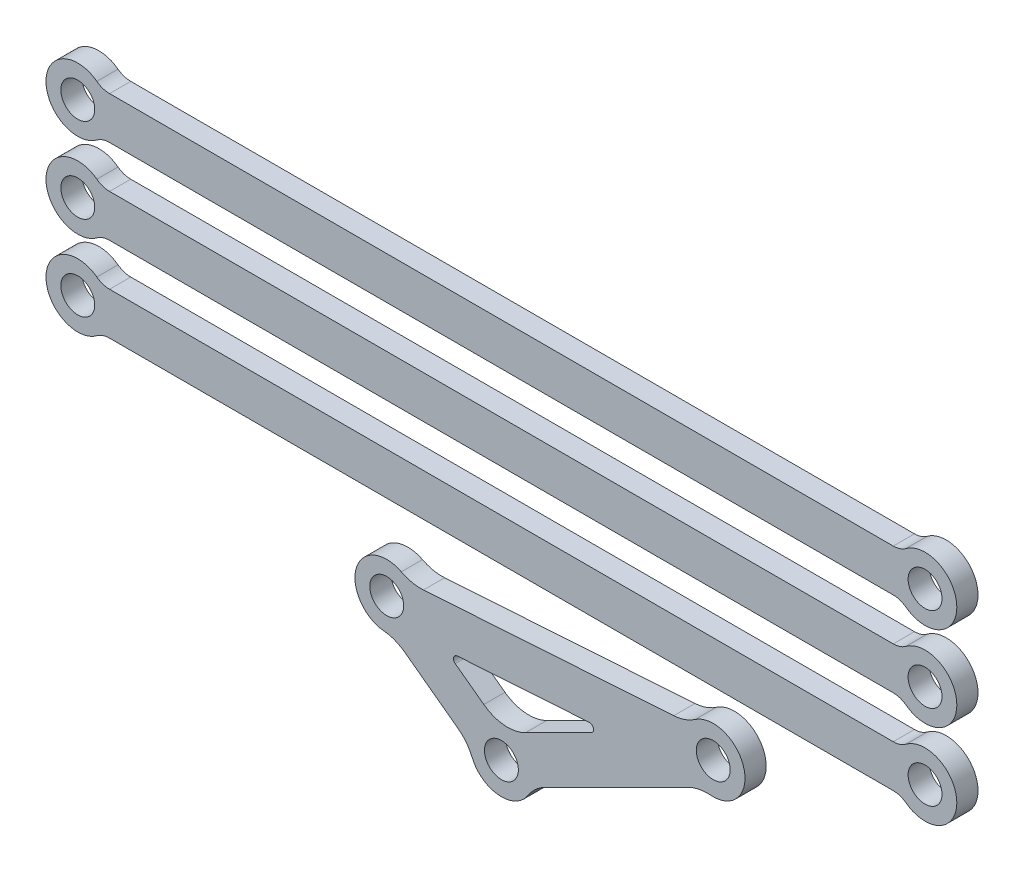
from build123d import *

# Parameters (mm, degrees)
CROQUIS1_R              = 4
SALIENTE_EXTRUIR1_DEPTH = 2.5
MATRIZL1_COUNT          = 2
MATRIZL1_PITCH          = 20
MATRIZL1_2_COUNT        = 2
MATRIZL1_2_PITCH        = 20
CROQUIS2_R              = 4
SALIENTE_EXTRUIR2_DEPTH = 2.5


with BuildPart() as part:
    # Croquis1 → Saliente-Extruir1 (new, symmetric)
    with BuildSketch(Plane.XY):
        with BuildLine():
            Line((-92.5, 5), (92.5, 5))
            ThreePointArc((92.5, 5), (94.08113883, 5.25658351), (95.5, 6))
            ThreePointArc((95.5, 6), (107.5, 0), (95.5, -6))
            ThreePointArc((95.5, -6), (94.08113883, -5.25658351), (92.5, -5))
            Line((92.5, -5), (-92.5, -5))
            ThreePointArc((-92.5, -5), (-94.08113883, -5.25658351), (-95.5, -6))
            ThreePointArc((-95.5, -6), (-107.5, 0), (-95.5, 6))
            ThreePointArc((-95.5, 6), (-94.08113883, 5.25658351), (-92.5, 5))
        make_face()
        with Locations((-100, 0)):
            Circle(CROQUIS1_R, mode=Mode.SUBTRACT)
        with Locations((100, 0)):
            Circle(CROQUIS1_R, mode=Mode.SUBTRACT)
    extrude(amount=SALIENTE_EXTRUIR1_DEPTH, both=True)


with BuildPart() as matrizl1_1:
    # MatrizL1: pattern copy
    add(part.part.moved(Location(Vector(0, -1, 0) * (1 * MATRIZL1_PITCH))))


with BuildPart() as matrizl1_2_1:
    # MatrizL1 2: pattern copy
    add(part.part.moved(Location(Vector(0, 1, 0) * (1 * MATRIZL1_2_PITCH))))


with BuildPart() as body_4:
    # Croquis2 → Saliente-Extruir2 (new, symmetric)
    with BuildSketch(Plane.XY):
        with BuildLine():
            Line((-18.399794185, -39.426938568), (40.681335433, -35.594039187))
            ThreePointArc((40.681335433, -35.594039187), (43.324791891, -35.058020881), (45.728833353, -33.835007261))
            ThreePointArc((45.728833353, -33.835007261), (57.239731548, -38.041355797), (49.419691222, -47.477515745))
            ThreePointArc((49.419691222, -47.477515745), (46.726945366, -47.633392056), (44.173810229, -48.503264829))
            Line((44.173810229, -48.503264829), (10.298325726, -65.441007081))
            ThreePointArc((10.298325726, -65.441007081), (8.070546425, -66.961591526), (6.330197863, -69.022262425))
            ThreePointArc((6.330197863, -69.022262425), (-0.646612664, -72.472074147), (-6.927069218, -67.875015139))
            ThreePointArc((-6.927069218, -67.875015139), (-8.287547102, -65.546007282), (-10.220989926, -63.665322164))
            Line((-10.220989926, -63.665322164), (-22.792249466, -54.377724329))
            ThreePointArc((-22.792249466, -54.377724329), (-25.157995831, -53.082185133), (-27.783933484, -52.466044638))
            ThreePointArc((-27.783933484, -52.466044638), (-34.266938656, -42.885894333), (-23.632260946, -38.334821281))
            ThreePointArc((-23.632260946, -38.334821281), (-21.090349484, -39.236965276), (-18.399794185, -39.426938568))
        make_face()
        with Locations((0, -65)):
            Circle(CROQUIS2_R, mode=Mode.SUBTRACT)
        with Locations((50, -40)):
            Circle(CROQUIS2_R, mode=Mode.SUBTRACT)
        with Locations((-27.07106781, -45)):
            Circle(CROQUIS2_R, mode=Mode.SUBTRACT)
        with BuildLine():
            Line((-10.901624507, -50.729372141), (-4.155930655, -55.71306462))
            ThreePointArc((-4.155930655, -55.71306462), (0.646612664, -57.527925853), (5.689532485, -56.565063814))
            Line((5.689532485, -56.565063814), (21.212344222, -48.803657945))
            ThreePointArc((21.212344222, -48.803657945), (21.730428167, -47.648078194), (20.700391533, -46.91132853))
            Line((20.700391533, -46.91132853), (-10.372146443, -48.927165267))
            ThreePointArc((-10.372146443, -48.927165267), (-11.266856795, -49.643186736), (-10.901624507, -50.729372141))
        make_face(mode=Mode.SUBTRACT)
    extrude(amount=SALIENTE_EXTRUIR2_DEPTH, both=True)


solid = Compound([part.part, matrizl1_1.part, matrizl1_2_1.part, body_4.part])
